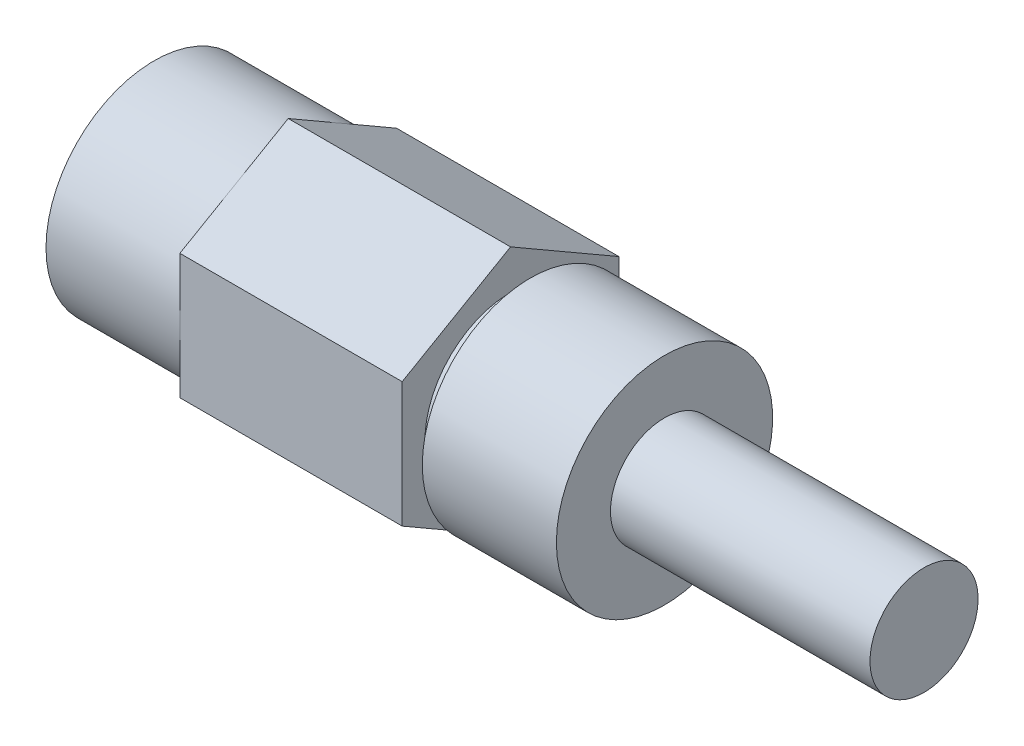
from build123d import *

# Parameters (mm, degrees)
BOSS_EXTRUDE1_DEPTH = 14.224
SKETCH4_W           = 1.1684
SKETCH4_H           = 2.317813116


with BuildPart() as part:
    # Sketch1 → Revolve1 (revolve)
    with BuildSketch(Plane.XY, mode=Mode.PRIVATE) as revolve1_sk:
        Polygon((0, 0), (0, 6.35), (7.874, 6.35), (7.874, 6.3627), (22.098, 6.3627), (22.098, 6.35), (29.972, 6.35), (29.972, 3.175), (45.212, 3.175), (45.212, 0), align=None)
    revolve(revolve1_sk.sketch.rotate(Axis((0, 0, 0), (1, 0, 0)), 90), axis=Axis((0, 0, 0), (1, 0, 0)))

    # Sketch2 → Boss-Extrude1 (add)
    with BuildSketch(Plane(origin=(22.098, 0, 0), x_dir=(0, 0, -1), z_dir=(1, 0, 0))):
        Polygon((-6.3627, 3.673506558), (-6.3627, -3.673506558), (0, -7.347013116), (6.3627, -3.673506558), (6.3627, 3.673506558), (0, 7.347013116), align=None)
    extrude(amount=-BOSS_EXTRUDE1_DEPTH)

    # Sketch4 → Cut-Revolve2 (revolve, cut)
    with BuildSketch(Plane(origin=(0, 0, 0), x_dir=(-1, 0, 0), z_dir=(0, 0, -1)), mode=Mode.PRIVATE) as cut_revolve2_sk:
        with Locations((-21.5138, 6.188106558)):
            Rectangle(SKETCH4_W, SKETCH4_H)
    revolve(cut_revolve2_sk.sketch.rotate(Axis((28.589361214, 0, 0), (-1, 0, 0)), 90), axis=Axis((28.589361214, 0, 0), (-1, 0, 0)), mode=Mode.SUBTRACT)


solid = part.part
